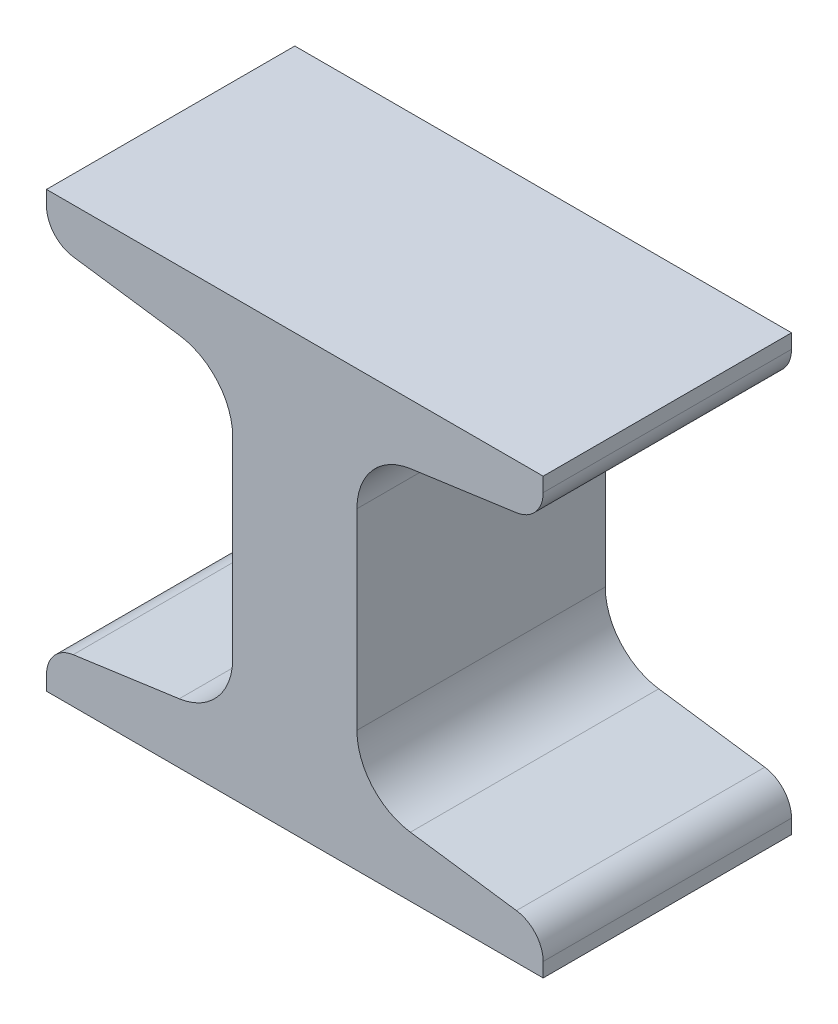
ISO-10303-21;
HEADER;
FILE_DESCRIPTION(('STEP AP214'),'2;1');
FILE_NAME('part.step','',(''),(''),'','','');
FILE_SCHEMA(('AUTOMOTIVE_DESIGN { 1 0 10303 214 1 1 1 1 }'));
ENDSEC;
DATA;
#1=APPLICATION_CONTEXT('core data for automotive mechanical design processes');
#2=APPLICATION_PROTOCOL_DEFINITION('international standard','automotive_design',2000,#1);
#3=PRODUCT_CONTEXT('',#1,'mechanical');
#4=PRODUCT('Part','Part','',(#3));
#5=PRODUCT_RELATED_PRODUCT_CATEGORY('part','',(#4));
#6=PRODUCT_DEFINITION_FORMATION('','',#4);
#7=PRODUCT_DEFINITION_CONTEXT('part definition',#1,'design');
#8=PRODUCT_DEFINITION('design','',#6,#7);
#9=PRODUCT_DEFINITION_SHAPE('','',#8);
#10=(LENGTH_UNIT() NAMED_UNIT(*) SI_UNIT(.MILLI.,.METRE.));
#11=(NAMED_UNIT(*) PLANE_ANGLE_UNIT() SI_UNIT($,.RADIAN.));
#12=(NAMED_UNIT(*) SI_UNIT($,.STERADIAN.) SOLID_ANGLE_UNIT());
#13=UNCERTAINTY_MEASURE_WITH_UNIT(LENGTH_MEASURE(1.E-05),#10,'distance_accuracy_value','');
#14=(GEOMETRIC_REPRESENTATION_CONTEXT(3) GLOBAL_UNCERTAINTY_ASSIGNED_CONTEXT((#13)) GLOBAL_UNIT_ASSIGNED_CONTEXT((#10,
#11,#12)) REPRESENTATION_CONTEXT('',''));
#15=CARTESIAN_POINT('',(0.,0.,0.));
#16=DIRECTION('',(0.,0.,1.));
#17=DIRECTION('',(1.,0.,0.));
#18=AXIS2_PLACEMENT_3D('',#15,#16,#17);
#19=CARTESIAN_POINT('',(50.8,-4.57140674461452E-13,12.7));
#20=DIRECTION('',(0.,-1.,0.));
#21=DIRECTION('',(1.,0.,0.));
#22=AXIS2_PLACEMENT_3D('',#19,#20,#21);
#23=PLANE('',#22);
#24=DIRECTION('',(-1.,0.,0.));
#25=VECTOR('',#24,1.);
#26=CARTESIAN_POINT('',(50.8,-4.57140674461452E-13,-12.7));
#27=LINE('',#26,#25);
#28=CARTESIAN_POINT('',(50.8,-4.57140674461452E-13,-12.7));
#29=VERTEX_POINT('',#28);
#30=CARTESIAN_POINT('',(0.,0.,-12.7));
#31=VERTEX_POINT('',#30);
#32=EDGE_CURVE('E234',#29,#31,#27,.T.);
#33=ORIENTED_EDGE('',*,*,#32,.F.);
#34=DIRECTION('',(0.,0.,-1.));
#35=VECTOR('',#34,1.);
#36=CARTESIAN_POINT('',(50.8,-4.57140674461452E-13,12.7));
#37=LINE('',#36,#35);
#38=CARTESIAN_POINT('',(50.8,-4.57140674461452E-13,12.7));
#39=VERTEX_POINT('',#38);
#40=EDGE_CURVE('E192',#39,#29,#37,.T.);
#41=ORIENTED_EDGE('',*,*,#40,.F.);
#42=DIRECTION('',(-1.,0.,0.));
#43=VECTOR('',#42,1.);
#44=CARTESIAN_POINT('',(50.8,-4.57140674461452E-13,12.7));
#45=LINE('',#44,#43);
#46=CARTESIAN_POINT('',(0.,0.,12.7));
#47=VERTEX_POINT('',#46);
#48=EDGE_CURVE('E187',#39,#47,#45,.T.);
#49=ORIENTED_EDGE('',*,*,#48,.T.);
#50=DIRECTION('',(0.,0.,-1.));
#51=VECTOR('',#50,1.);
#52=CARTESIAN_POINT('',(0.,0.,12.7));
#53=LINE('',#52,#51);
#54=EDGE_CURVE('E170',#47,#31,#53,.T.);
#55=ORIENTED_EDGE('',*,*,#54,.T.);
#56=EDGE_LOOP('',(#33,#41,#49,#55));
#57=FACE_BOUND('',#56,.T.);
#58=ADVANCED_FACE('F33',(#57),#23,.T.);
#59=CARTESIAN_POINT('',(50.8,4.22213794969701,12.7));
#60=DIRECTION('',(1.,0.,0.));
#61=DIRECTION('',(0.,1.,0.));
#62=AXIS2_PLACEMENT_3D('',#59,#60,#61);
#63=PLANE('',#62);
#64=DIRECTION('',(0.,-1.,0.));
#65=VECTOR('',#64,1.);
#66=CARTESIAN_POINT('',(50.8,4.22213794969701,-12.7));
#67=LINE('',#66,#65);
#68=CARTESIAN_POINT('',(50.8,1.46064423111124,-12.7));
#69=VERTEX_POINT('',#68);
#70=EDGE_CURVE('E193',#69,#29,#67,.T.);
#71=ORIENTED_EDGE('',*,*,#70,.F.);
#72=DIRECTION('',(0.,0.,-1.));
#73=VECTOR('',#72,1.);
#74=CARTESIAN_POINT('',(50.8,1.46064423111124,12.7));
#75=LINE('',#74,#73);
#76=CARTESIAN_POINT('',(50.8,1.46064423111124,12.7));
#77=VERTEX_POINT('',#76);
#78=EDGE_CURVE('E306',#69,#77,#75,.F.);
#79=ORIENTED_EDGE('',*,*,#78,.T.);
#80=DIRECTION('',(0.,-1.,0.));
#81=VECTOR('',#80,1.);
#82=CARTESIAN_POINT('',(50.8,4.22213794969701,12.7));
#83=LINE('',#82,#81);
#84=EDGE_CURVE('E182',#77,#39,#83,.T.);
#85=ORIENTED_EDGE('',*,*,#84,.T.);
#86=ORIENTED_EDGE('',*,*,#40,.T.);
#87=EDGE_LOOP('',(#71,#79,#85,#86));
#88=FACE_BOUND('',#87,.T.);
#89=ADVANCED_FACE('F383',(#88),#63,.T.);
#90=CARTESIAN_POINT('',(37.2196531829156,6.12323899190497,12.7));
#91=DIRECTION('',(0.138637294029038,0.990343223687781,0.));
#92=DIRECTION('',(-0.990343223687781,0.138637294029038,0.));
#93=AXIS2_PLACEMENT_3D('',#90,#91,#92);
#94=PLANE('',#93);
#95=DIRECTION('',(0.990343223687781,-0.138637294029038,0.));
#96=VECTOR('',#95,1.);
#97=CARTESIAN_POINT('',(37.2196531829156,6.12323899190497,12.7));
#98=LINE('',#97,#96);
#99=CARTESIAN_POINT('',(37.2196531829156,6.12323899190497,12.7));
#100=VERTEX_POINT('',#99);
#101=CARTESIAN_POINT('',(48.0651734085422,4.60498396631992,12.7));
#102=VERTEX_POINT('',#101);
#103=EDGE_CURVE('E230',#100,#102,#98,.T.);
#104=ORIENTED_EDGE('',*,*,#103,.T.);
#105=DIRECTION('',(0.,0.,-1.));
#106=VECTOR('',#105,1.);
#107=CARTESIAN_POINT('',(48.0651734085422,4.60498396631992,12.7));
#108=LINE('',#107,#106);
#109=CARTESIAN_POINT('',(48.0651734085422,4.60498396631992,-12.7));
#110=VERTEX_POINT('',#109);
#111=EDGE_CURVE('E273',#102,#110,#108,.T.);
#112=ORIENTED_EDGE('',*,*,#111,.T.);
#113=DIRECTION('',(0.990343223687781,-0.138637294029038,0.));
#114=VECTOR('',#113,1.);
#115=CARTESIAN_POINT('',(37.2196531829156,6.12323899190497,-12.7));
#116=LINE('',#115,#114);
#117=CARTESIAN_POINT('',(37.2196531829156,6.12323899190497,-12.7));
#118=VERTEX_POINT('',#117);
#119=EDGE_CURVE('E195',#118,#110,#116,.T.);
#120=ORIENTED_EDGE('',*,*,#119,.F.);
#121=DIRECTION('',(0.,0.,-1.));
#122=VECTOR('',#121,1.);
#123=CARTESIAN_POINT('',(37.2196531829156,6.12323899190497,12.7));
#124=LINE('',#123,#122);
#125=EDGE_CURVE('E274',#100,#118,#124,.T.);
#126=ORIENTED_EDGE('',*,*,#125,.F.);
#127=EDGE_LOOP('',(#104,#112,#120,#126));
#128=FACE_BOUND('',#127,.T.);
#129=ADVANCED_FACE('F377',(#128),#94,.T.);
#130=CARTESIAN_POINT('',(38.1,12.4119184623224,12.7));
#131=DIRECTION('',(0.,0.,-1.));
#132=DIRECTION('',(-1.,0.,0.));
#133=AXIS2_PLACEMENT_3D('',#130,#131,#132);
#134=CYLINDRICAL_SURFACE('',#133,6.35);
#135=CARTESIAN_POINT('',(38.1,12.4119184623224,-12.7));
#136=DIRECTION('',(0.,0.,1.));
#137=DIRECTION('',(1.,0.,0.));
#138=AXIS2_PLACEMENT_3D('',#135,#136,#137);
#139=CIRCLE('',#138,6.35);
#140=CARTESIAN_POINT('',(31.75,12.4119184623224,-12.7));
#141=VERTEX_POINT('',#140);
#142=EDGE_CURVE('E267',#141,#118,#139,.T.);
#143=ORIENTED_EDGE('',*,*,#142,.F.);
#144=DIRECTION('',(0.,0.,-1.));
#145=VECTOR('',#144,1.);
#146=CARTESIAN_POINT('',(31.75,12.4119184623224,12.7));
#147=LINE('',#146,#145);
#148=CARTESIAN_POINT('',(31.75,12.4119184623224,12.7));
#149=VERTEX_POINT('',#148);
#150=EDGE_CURVE('E276',#149,#141,#147,.T.);
#151=ORIENTED_EDGE('',*,*,#150,.F.);
#152=CARTESIAN_POINT('',(38.1,12.4119184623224,12.7));
#153=DIRECTION('',(0.,0.,1.));
#154=DIRECTION('',(1.,0.,0.));
#155=AXIS2_PLACEMENT_3D('',#152,#153,#154);
#156=CIRCLE('',#155,6.35);
#157=EDGE_CURVE('E227',#149,#100,#156,.T.);
#158=ORIENTED_EDGE('',*,*,#157,.T.);
#159=ORIENTED_EDGE('',*,*,#125,.T.);
#160=EDGE_LOOP('',(#143,#151,#158,#159));
#161=FACE_BOUND('',#160,.T.);
#162=ADVANCED_FACE('F373',(#161),#134,.F.);
#163=CARTESIAN_POINT('',(31.75,32.0380815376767,12.7));
#164=DIRECTION('',(1.,0.,0.));
#165=DIRECTION('',(0.,1.,0.));
#166=AXIS2_PLACEMENT_3D('',#163,#164,#165);
#167=PLANE('',#166);
#168=DIRECTION('',(0.,-1.,0.));
#169=VECTOR('',#168,1.);
#170=CARTESIAN_POINT('',(31.75,32.0380815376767,-12.7));
#171=LINE('',#170,#169);
#172=CARTESIAN_POINT('',(31.75,32.0380815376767,-12.7));
#173=VERTEX_POINT('',#172);
#174=EDGE_CURVE('E264',#173,#141,#171,.T.);
#175=ORIENTED_EDGE('',*,*,#174,.F.);
#176=DIRECTION('',(0.,0.,-1.));
#177=VECTOR('',#176,1.);
#178=CARTESIAN_POINT('',(31.75,32.0380815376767,12.7));
#179=LINE('',#178,#177);
#180=CARTESIAN_POINT('',(31.75,32.0380815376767,12.7));
#181=VERTEX_POINT('',#180);
#182=EDGE_CURVE('E278',#181,#173,#179,.T.);
#183=ORIENTED_EDGE('',*,*,#182,.F.);
#184=DIRECTION('',(0.,-1.,0.));
#185=VECTOR('',#184,1.);
#186=CARTESIAN_POINT('',(31.75,32.0380815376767,12.7));
#187=LINE('',#186,#185);
#188=EDGE_CURVE('E224',#181,#149,#187,.T.);
#189=ORIENTED_EDGE('',*,*,#188,.T.);
#190=ORIENTED_EDGE('',*,*,#150,.T.);
#191=EDGE_LOOP('',(#175,#183,#189,#190));
#192=FACE_BOUND('',#191,.T.);
#193=ADVANCED_FACE('F369',(#192),#167,.T.);
#194=CARTESIAN_POINT('',(38.1,32.0380815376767,12.7));
#195=DIRECTION('',(0.,0.,-1.));
#196=DIRECTION('',(-1.,0.,0.));
#197=AXIS2_PLACEMENT_3D('',#194,#195,#196);
#198=CYLINDRICAL_SURFACE('',#197,6.34999999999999);
#199=CARTESIAN_POINT('',(38.1,32.0380815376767,-12.7));
#200=DIRECTION('',(0.,0.,1.));
#201=DIRECTION('',(1.,0.,0.));
#202=AXIS2_PLACEMENT_3D('',#199,#200,#201);
#203=CIRCLE('',#202,6.34999999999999);
#204=CARTESIAN_POINT('',(37.2196531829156,38.3267610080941,-12.7));
#205=VERTEX_POINT('',#204);
#206=EDGE_CURVE('E261',#205,#173,#203,.T.);
#207=ORIENTED_EDGE('',*,*,#206,.F.);
#208=DIRECTION('',(0.,0.,-1.));
#209=VECTOR('',#208,1.);
#210=CARTESIAN_POINT('',(37.2196531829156,38.3267610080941,12.7));
#211=LINE('',#210,#209);
#212=CARTESIAN_POINT('',(37.2196531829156,38.3267610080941,12.7));
#213=VERTEX_POINT('',#212);
#214=EDGE_CURVE('E280',#213,#205,#211,.T.);
#215=ORIENTED_EDGE('',*,*,#214,.F.);
#216=CARTESIAN_POINT('',(38.1,32.0380815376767,12.7));
#217=DIRECTION('',(0.,0.,1.));
#218=DIRECTION('',(1.,0.,0.));
#219=AXIS2_PLACEMENT_3D('',#216,#217,#218);
#220=CIRCLE('',#219,6.34999999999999);
#221=EDGE_CURVE('E221',#213,#181,#220,.T.);
#222=ORIENTED_EDGE('',*,*,#221,.T.);
#223=ORIENTED_EDGE('',*,*,#182,.T.);
#224=EDGE_LOOP('',(#207,#215,#222,#223));
#225=FACE_BOUND('',#224,.T.);
#226=ADVANCED_FACE('F365',(#225),#198,.F.);
#227=CARTESIAN_POINT('',(50.8,40.2278620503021,12.7));
#228=DIRECTION('',(0.138637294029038,-0.990343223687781,0.));
#229=DIRECTION('',(0.990343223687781,0.138637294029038,0.));
#230=AXIS2_PLACEMENT_3D('',#227,#228,#229);
#231=PLANE('',#230);
#232=DIRECTION('',(-0.990343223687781,-0.138637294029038,0.));
#233=VECTOR('',#232,1.);
#234=CARTESIAN_POINT('',(50.8,40.2278620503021,-12.7));
#235=LINE('',#234,#233);
#236=CARTESIAN_POINT('',(48.0651734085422,39.8450160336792,-12.7));
#237=VERTEX_POINT('',#236);
#238=EDGE_CURVE('E259',#237,#205,#235,.T.);
#239=ORIENTED_EDGE('',*,*,#238,.F.);
#240=DIRECTION('',(0.,0.,-1.));
#241=VECTOR('',#240,1.);
#242=CARTESIAN_POINT('',(48.0651734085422,39.8450160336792,12.7));
#243=LINE('',#242,#241);
#244=CARTESIAN_POINT('',(48.0651734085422,39.8450160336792,12.7));
#245=VERTEX_POINT('',#244);
#246=EDGE_CURVE('E321',#237,#245,#243,.F.);
#247=ORIENTED_EDGE('',*,*,#246,.T.);
#248=DIRECTION('',(-0.990343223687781,-0.138637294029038,0.));
#249=VECTOR('',#248,1.);
#250=CARTESIAN_POINT('',(50.8,40.2278620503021,12.7));
#251=LINE('',#250,#249);
#252=EDGE_CURVE('E219',#245,#213,#251,.T.);
#253=ORIENTED_EDGE('',*,*,#252,.T.);
#254=ORIENTED_EDGE('',*,*,#214,.T.);
#255=EDGE_LOOP('',(#239,#247,#253,#254));
#256=FACE_BOUND('',#255,.T.);
#257=ADVANCED_FACE('F359',(#256),#231,.T.);
#258=CARTESIAN_POINT('',(50.8,44.4499999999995,12.7));
#259=DIRECTION('',(1.,0.,0.));
#260=DIRECTION('',(0.,1.,0.));
#261=AXIS2_PLACEMENT_3D('',#258,#259,#260);
#262=PLANE('',#261);
#263=DIRECTION('',(0.,-1.,0.));
#264=VECTOR('',#263,1.);
#265=CARTESIAN_POINT('',(50.8,44.4499999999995,12.7));
#266=LINE('',#265,#264);
#267=CARTESIAN_POINT('',(50.8,44.4499999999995,12.7));
#268=VERTEX_POINT('',#267);
#269=CARTESIAN_POINT('',(50.8,42.9893557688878,12.7));
#270=VERTEX_POINT('',#269);
#271=EDGE_CURVE('E216',#268,#270,#266,.T.);
#272=ORIENTED_EDGE('',*,*,#271,.T.);
#273=DIRECTION('',(0.,0.,-1.));
#274=VECTOR('',#273,1.);
#275=CARTESIAN_POINT('',(50.8,42.9893557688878,12.7));
#276=LINE('',#275,#274);
#277=CARTESIAN_POINT('',(50.8,42.9893557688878,-12.7));
#278=VERTEX_POINT('',#277);
#279=EDGE_CURVE('E318',#270,#278,#276,.T.);
#280=ORIENTED_EDGE('',*,*,#279,.T.);
#281=DIRECTION('',(0.,-1.,0.));
#282=VECTOR('',#281,1.);
#283=CARTESIAN_POINT('',(50.8,44.4499999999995,-12.7));
#284=LINE('',#283,#282);
#285=CARTESIAN_POINT('',(50.8,44.4499999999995,-12.7));
#286=VERTEX_POINT('',#285);
#287=EDGE_CURVE('E256',#286,#278,#284,.T.);
#288=ORIENTED_EDGE('',*,*,#287,.F.);
#289=DIRECTION('',(0.,0.,-1.));
#290=VECTOR('',#289,1.);
#291=CARTESIAN_POINT('',(50.8,44.4499999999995,12.7));
#292=LINE('',#291,#290);
#293=EDGE_CURVE('E283',#268,#286,#292,.T.);
#294=ORIENTED_EDGE('',*,*,#293,.F.);
#295=EDGE_LOOP('',(#272,#280,#288,#294));
#296=FACE_BOUND('',#295,.T.);
#297=ADVANCED_FACE('F351',(#296),#262,.T.);
#298=CARTESIAN_POINT('',(0.,44.4499999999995,12.7));
#299=DIRECTION('',(0.,1.,0.));
#300=DIRECTION('',(0.,0.,1.));
#301=AXIS2_PLACEMENT_3D('',#298,#299,#300);
#302=PLANE('',#301);
#303=DIRECTION('',(1.,0.,0.));
#304=VECTOR('',#303,1.);
#305=CARTESIAN_POINT('',(0.,44.4499999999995,-12.7));
#306=LINE('',#305,#304);
#307=CARTESIAN_POINT('',(0.,44.4499999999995,-12.7));
#308=VERTEX_POINT('',#307);
#309=EDGE_CURVE('E253',#308,#286,#306,.T.);
#310=ORIENTED_EDGE('',*,*,#309,.F.);
#311=DIRECTION('',(0.,0.,-1.));
#312=VECTOR('',#311,1.);
#313=CARTESIAN_POINT('',(0.,44.4499999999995,12.7));
#314=LINE('',#313,#312);
#315=CARTESIAN_POINT('',(0.,44.4499999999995,12.7));
#316=VERTEX_POINT('',#315);
#317=EDGE_CURVE('E285',#316,#308,#314,.T.);
#318=ORIENTED_EDGE('',*,*,#317,.F.);
#319=DIRECTION('',(1.,0.,0.));
#320=VECTOR('',#319,1.);
#321=CARTESIAN_POINT('',(0.,44.4499999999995,12.7));
#322=LINE('',#321,#320);
#323=EDGE_CURVE('E213',#316,#268,#322,.T.);
#324=ORIENTED_EDGE('',*,*,#323,.T.);
#325=ORIENTED_EDGE('',*,*,#293,.T.);
#326=EDGE_LOOP('',(#310,#318,#324,#325));
#327=FACE_BOUND('',#326,.T.);
#328=ADVANCED_FACE('F348',(#327),#302,.T.);
#329=CARTESIAN_POINT('',(0.,40.2278620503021,12.7));
#330=DIRECTION('',(-1.,0.,0.));
#331=DIRECTION('',(0.,-1.,0.));
#332=AXIS2_PLACEMENT_3D('',#329,#330,#331);
#333=PLANE('',#332);
#334=DIRECTION('',(0.,1.,0.));
#335=VECTOR('',#334,1.);
#336=CARTESIAN_POINT('',(0.,40.2278620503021,-12.7));
#337=LINE('',#336,#335);
#338=CARTESIAN_POINT('',(0.,42.9893557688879,-12.7));
#339=VERTEX_POINT('',#338);
#340=EDGE_CURVE('E251',#339,#308,#337,.T.);
#341=ORIENTED_EDGE('',*,*,#340,.F.);
#342=DIRECTION('',(0.,0.,-1.));
#343=VECTOR('',#342,1.);
#344=CARTESIAN_POINT('',(0.,42.9893557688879,12.7));
#345=LINE('',#344,#343);
#346=CARTESIAN_POINT('',(0.,42.9893557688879,12.7));
#347=VERTEX_POINT('',#346);
#348=EDGE_CURVE('E11',#339,#347,#345,.F.);
#349=ORIENTED_EDGE('',*,*,#348,.T.);
#350=DIRECTION('',(0.,1.,0.));
#351=VECTOR('',#350,1.);
#352=CARTESIAN_POINT('',(0.,40.2278620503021,12.7));
#353=LINE('',#352,#351);
#354=EDGE_CURVE('E211',#347,#316,#353,.T.);
#355=ORIENTED_EDGE('',*,*,#354,.T.);
#356=ORIENTED_EDGE('',*,*,#317,.T.);
#357=EDGE_LOOP('',(#341,#349,#355,#356));
#358=FACE_BOUND('',#357,.T.);
#359=ADVANCED_FACE('F343',(#358),#333,.T.);
#360=CARTESIAN_POINT('',(13.5803468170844,38.3267610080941,12.7));
#361=DIRECTION('',(-0.138637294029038,-0.990343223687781,0.));
#362=DIRECTION('',(0.990343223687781,-0.138637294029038,0.));
#363=AXIS2_PLACEMENT_3D('',#360,#361,#362);
#364=PLANE('',#363);
#365=DIRECTION('',(-0.990343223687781,0.138637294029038,0.));
#366=VECTOR('',#365,1.);
#367=CARTESIAN_POINT('',(13.5803468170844,38.3267610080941,12.7));
#368=LINE('',#367,#366);
#369=CARTESIAN_POINT('',(13.5803468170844,38.3267610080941,12.7));
#370=VERTEX_POINT('',#369);
#371=CARTESIAN_POINT('',(2.73482659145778,39.8450160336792,12.7));
#372=VERTEX_POINT('',#371);
#373=EDGE_CURVE('E208',#370,#372,#368,.T.);
#374=ORIENTED_EDGE('',*,*,#373,.T.);
#375=DIRECTION('',(0.,0.,-1.));
#376=VECTOR('',#375,1.);
#377=CARTESIAN_POINT('',(2.73482659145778,39.8450160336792,12.7));
#378=LINE('',#377,#376);
#379=CARTESIAN_POINT('',(2.73482659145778,39.8450160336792,-12.7));
#380=VERTEX_POINT('',#379);
#381=EDGE_CURVE('E41',#372,#380,#378,.T.);
#382=ORIENTED_EDGE('',*,*,#381,.T.);
#383=DIRECTION('',(-0.990343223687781,0.138637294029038,0.));
#384=VECTOR('',#383,1.);
#385=CARTESIAN_POINT('',(13.5803468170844,38.3267610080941,-12.7));
#386=LINE('',#385,#384);
#387=CARTESIAN_POINT('',(13.5803468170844,38.3267610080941,-12.7));
#388=VERTEX_POINT('',#387);
#389=EDGE_CURVE('E248',#388,#380,#386,.T.);
#390=ORIENTED_EDGE('',*,*,#389,.F.);
#391=DIRECTION('',(0.,0.,-1.));
#392=VECTOR('',#391,1.);
#393=CARTESIAN_POINT('',(13.5803468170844,38.3267610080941,12.7));
#394=LINE('',#393,#392);
#395=EDGE_CURVE('E288',#370,#388,#394,.T.);
#396=ORIENTED_EDGE('',*,*,#395,.F.);
#397=EDGE_LOOP('',(#374,#382,#390,#396));
#398=FACE_BOUND('',#397,.T.);
#399=ADVANCED_FACE('F326',(#398),#364,.T.);
#400=CARTESIAN_POINT('',(12.7,32.0380815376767,12.7));
#401=DIRECTION('',(0.,0.,-1.));
#402=DIRECTION('',(-1.,0.,0.));
#403=AXIS2_PLACEMENT_3D('',#400,#401,#402);
#404=CYLINDRICAL_SURFACE('',#403,6.35);
#405=CARTESIAN_POINT('',(12.7,32.0380815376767,-12.7));
#406=DIRECTION('',(0.,0.,1.));
#407=DIRECTION('',(1.,0.,0.));
#408=AXIS2_PLACEMENT_3D('',#405,#406,#407);
#409=CIRCLE('',#408,6.35);
#410=CARTESIAN_POINT('',(19.05,32.0380815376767,-12.7));
#411=VERTEX_POINT('',#410);
#412=EDGE_CURVE('E245',#411,#388,#409,.T.);
#413=ORIENTED_EDGE('',*,*,#412,.F.);
#414=DIRECTION('',(0.,0.,-1.));
#415=VECTOR('',#414,1.);
#416=CARTESIAN_POINT('',(19.05,32.0380815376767,12.7));
#417=LINE('',#416,#415);
#418=CARTESIAN_POINT('',(19.05,32.0380815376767,12.7));
#419=VERTEX_POINT('',#418);
#420=EDGE_CURVE('E290',#419,#411,#417,.T.);
#421=ORIENTED_EDGE('',*,*,#420,.F.);
#422=CARTESIAN_POINT('',(12.7,32.0380815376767,12.7));
#423=DIRECTION('',(0.,0.,1.));
#424=DIRECTION('',(1.,0.,0.));
#425=AXIS2_PLACEMENT_3D('',#422,#423,#424);
#426=CIRCLE('',#425,6.35);
#427=EDGE_CURVE('E205',#419,#370,#426,.T.);
#428=ORIENTED_EDGE('',*,*,#427,.T.);
#429=ORIENTED_EDGE('',*,*,#395,.T.);
#430=EDGE_LOOP('',(#413,#421,#428,#429));
#431=FACE_BOUND('',#430,.T.);
#432=ADVANCED_FACE('F336',(#431),#404,.F.);
#433=CARTESIAN_POINT('',(19.05,12.4119184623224,12.7));
#434=DIRECTION('',(-1.,0.,0.));
#435=DIRECTION('',(0.,0.,1.));
#436=AXIS2_PLACEMENT_3D('',#433,#434,#435);
#437=PLANE('',#436);
#438=DIRECTION('',(0.,1.,0.));
#439=VECTOR('',#438,1.);
#440=CARTESIAN_POINT('',(19.05,12.4119184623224,-12.7));
#441=LINE('',#440,#439);
#442=CARTESIAN_POINT('',(19.05,12.4119184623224,-12.7));
#443=VERTEX_POINT('',#442);
#444=EDGE_CURVE('E242',#443,#411,#441,.T.);
#445=ORIENTED_EDGE('',*,*,#444,.F.);
#446=DIRECTION('',(0.,0.,-1.));
#447=VECTOR('',#446,1.);
#448=CARTESIAN_POINT('',(19.05,12.4119184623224,12.7));
#449=LINE('',#448,#447);
#450=CARTESIAN_POINT('',(19.05,12.4119184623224,12.7));
#451=VERTEX_POINT('',#450);
#452=EDGE_CURVE('E292',#451,#443,#449,.T.);
#453=ORIENTED_EDGE('',*,*,#452,.F.);
#454=DIRECTION('',(0.,1.,0.));
#455=VECTOR('',#454,1.);
#456=CARTESIAN_POINT('',(19.05,12.4119184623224,12.7));
#457=LINE('',#456,#455);
#458=EDGE_CURVE('E202',#451,#419,#457,.T.);
#459=ORIENTED_EDGE('',*,*,#458,.T.);
#460=ORIENTED_EDGE('',*,*,#420,.T.);
#461=EDGE_LOOP('',(#445,#453,#459,#460));
#462=FACE_BOUND('',#461,.T.);
#463=ADVANCED_FACE('F411',(#462),#437,.T.);
#464=CARTESIAN_POINT('',(12.7,12.4119184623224,12.7));
#465=DIRECTION('',(0.,0.,-1.));
#466=DIRECTION('',(-1.,0.,0.));
#467=AXIS2_PLACEMENT_3D('',#464,#465,#466);
#468=CYLINDRICAL_SURFACE('',#467,6.35);
#469=CARTESIAN_POINT('',(12.7,12.4119184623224,-12.7));
#470=DIRECTION('',(0.,0.,1.));
#471=DIRECTION('',(1.,0.,0.));
#472=AXIS2_PLACEMENT_3D('',#469,#470,#471);
#473=CIRCLE('',#472,6.35);
#474=CARTESIAN_POINT('',(13.5803468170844,6.12323899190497,-12.7));
#475=VERTEX_POINT('',#474);
#476=EDGE_CURVE('E239',#475,#443,#473,.T.);
#477=ORIENTED_EDGE('',*,*,#476,.F.);
#478=DIRECTION('',(0.,0.,-1.));
#479=VECTOR('',#478,1.);
#480=CARTESIAN_POINT('',(13.5803468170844,6.12323899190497,12.7));
#481=LINE('',#480,#479);
#482=CARTESIAN_POINT('',(13.5803468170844,6.12323899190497,12.7));
#483=VERTEX_POINT('',#482);
#484=EDGE_CURVE('E181',#483,#475,#481,.T.);
#485=ORIENTED_EDGE('',*,*,#484,.F.);
#486=CARTESIAN_POINT('',(12.7,12.4119184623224,12.7));
#487=DIRECTION('',(0.,0.,1.));
#488=DIRECTION('',(1.,0.,0.));
#489=AXIS2_PLACEMENT_3D('',#486,#487,#488);
#490=CIRCLE('',#489,6.35);
#491=EDGE_CURVE('E199',#483,#451,#490,.T.);
#492=ORIENTED_EDGE('',*,*,#491,.T.);
#493=ORIENTED_EDGE('',*,*,#452,.T.);
#494=EDGE_LOOP('',(#477,#485,#492,#493));
#495=FACE_BOUND('',#494,.T.);
#496=ADVANCED_FACE('F408',(#495),#468,.F.);
#497=CARTESIAN_POINT('',(0.,4.222137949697,12.7));
#498=DIRECTION('',(-0.138637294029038,0.990343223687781,0.));
#499=DIRECTION('',(-0.990343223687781,-0.138637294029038,0.));
#500=AXIS2_PLACEMENT_3D('',#497,#498,#499);
#501=PLANE('',#500);
#502=DIRECTION('',(0.990343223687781,0.138637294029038,0.));
#503=VECTOR('',#502,1.);
#504=CARTESIAN_POINT('',(0.,4.222137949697,-12.7));
#505=LINE('',#504,#503);
#506=CARTESIAN_POINT('',(2.73482659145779,4.60498396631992,-12.7));
#507=VERTEX_POINT('',#506);
#508=EDGE_CURVE('E237',#507,#475,#505,.T.);
#509=ORIENTED_EDGE('',*,*,#508,.F.);
#510=DIRECTION('',(0.,0.,-1.));
#511=VECTOR('',#510,1.);
#512=CARTESIAN_POINT('',(2.73482659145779,4.60498396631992,12.7));
#513=LINE('',#512,#511);
#514=CARTESIAN_POINT('',(2.73482659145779,4.60498396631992,12.7));
#515=VERTEX_POINT('',#514);
#516=EDGE_CURVE('E56',#507,#515,#513,.F.);
#517=ORIENTED_EDGE('',*,*,#516,.T.);
#518=DIRECTION('',(0.990343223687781,0.138637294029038,0.));
#519=VECTOR('',#518,1.);
#520=CARTESIAN_POINT('',(0.,4.222137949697,12.7));
#521=LINE('',#520,#519);
#522=EDGE_CURVE('E188',#515,#483,#521,.T.);
#523=ORIENTED_EDGE('',*,*,#522,.T.);
#524=ORIENTED_EDGE('',*,*,#484,.T.);
#525=EDGE_LOOP('',(#509,#517,#523,#524));
#526=FACE_BOUND('',#525,.T.);
#527=ADVANCED_FACE('F405',(#526),#501,.T.);
#528=CARTESIAN_POINT('',(0.,0.,12.7));
#529=DIRECTION('',(-1.,0.,0.));
#530=DIRECTION('',(0.,-1.,0.));
#531=AXIS2_PLACEMENT_3D('',#528,#529,#530);
#532=PLANE('',#531);
#533=DIRECTION('',(0.,1.,0.));
#534=VECTOR('',#533,1.);
#535=CARTESIAN_POINT('',(0.,0.,12.7));
#536=LINE('',#535,#534);
#537=CARTESIAN_POINT('',(0.,1.46064423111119,12.7));
#538=VERTEX_POINT('',#537);
#539=EDGE_CURVE('E173',#47,#538,#536,.T.);
#540=ORIENTED_EDGE('',*,*,#539,.T.);
#541=DIRECTION('',(0.,0.,-1.));
#542=VECTOR('',#541,1.);
#543=CARTESIAN_POINT('',(0.,1.46064423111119,12.7));
#544=LINE('',#543,#542);
#545=CARTESIAN_POINT('',(0.,1.46064423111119,-12.7));
#546=VERTEX_POINT('',#545);
#547=EDGE_CURVE('E315',#538,#546,#544,.T.);
#548=ORIENTED_EDGE('',*,*,#547,.T.);
#549=DIRECTION('',(0.,1.,0.));
#550=VECTOR('',#549,1.);
#551=CARTESIAN_POINT('',(0.,0.,-12.7));
#552=LINE('',#551,#550);
#553=EDGE_CURVE('E176',#31,#546,#552,.T.);
#554=ORIENTED_EDGE('',*,*,#553,.F.);
#555=ORIENTED_EDGE('',*,*,#54,.F.);
#556=EDGE_LOOP('',(#540,#548,#554,#555));
#557=FACE_BOUND('',#556,.T.);
#558=ADVANCED_FACE('F171',(#557),#532,.T.);
#559=CARTESIAN_POINT('',(12.7,12.4119184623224,12.7));
#560=DIRECTION('',(0.,0.,1.));
#561=DIRECTION('',(1.,0.,0.));
#562=AXIS2_PLACEMENT_3D('',#559,#560,#561);
#563=PLANE('',#562);
#564=ORIENTED_EDGE('',*,*,#84,.F.);
#565=CARTESIAN_POINT('',(47.625,1.46064423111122,12.7));
#566=DIRECTION('',(0.,0.,1.));
#567=DIRECTION('',(1.,0.,0.));
#568=AXIS2_PLACEMENT_3D('',#565,#566,#567);
#569=CIRCLE('',#568,3.175);
#570=EDGE_CURVE('E313',#77,#102,#569,.T.);
#571=ORIENTED_EDGE('',*,*,#570,.T.);
#572=ORIENTED_EDGE('',*,*,#103,.F.);
#573=ORIENTED_EDGE('',*,*,#157,.F.);
#574=ORIENTED_EDGE('',*,*,#188,.F.);
#575=ORIENTED_EDGE('',*,*,#221,.F.);
#576=ORIENTED_EDGE('',*,*,#252,.F.);
#577=CARTESIAN_POINT('',(47.625,42.9893557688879,12.7));
#578=DIRECTION('',(0.,0.,1.));
#579=DIRECTION('',(1.,0.,0.));
#580=AXIS2_PLACEMENT_3D('',#577,#578,#579);
#581=CIRCLE('',#580,3.175);
#582=EDGE_CURVE('E310',#245,#270,#581,.T.);
#583=ORIENTED_EDGE('',*,*,#582,.T.);
#584=ORIENTED_EDGE('',*,*,#271,.F.);
#585=ORIENTED_EDGE('',*,*,#323,.F.);
#586=ORIENTED_EDGE('',*,*,#354,.F.);
#587=CARTESIAN_POINT('',(3.17499999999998,42.9893557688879,12.7));
#588=DIRECTION('',(0.,0.,1.));
#589=DIRECTION('',(1.,0.,0.));
#590=AXIS2_PLACEMENT_3D('',#587,#588,#589);
#591=CIRCLE('',#590,3.175);
#592=EDGE_CURVE('E308',#347,#372,#591,.T.);
#593=ORIENTED_EDGE('',*,*,#592,.T.);
#594=ORIENTED_EDGE('',*,*,#373,.F.);
#595=ORIENTED_EDGE('',*,*,#427,.F.);
#596=ORIENTED_EDGE('',*,*,#458,.F.);
#597=ORIENTED_EDGE('',*,*,#491,.F.);
#598=ORIENTED_EDGE('',*,*,#522,.F.);
#599=CARTESIAN_POINT('',(3.17499999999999,1.46064423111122,12.7));
#600=DIRECTION('',(0.,0.,1.));
#601=DIRECTION('',(1.,0.,0.));
#602=AXIS2_PLACEMENT_3D('',#599,#600,#601);
#603=CIRCLE('',#602,3.175);
#604=EDGE_CURVE('E48',#515,#538,#603,.T.);
#605=ORIENTED_EDGE('',*,*,#604,.T.);
#606=ORIENTED_EDGE('',*,*,#539,.F.);
#607=ORIENTED_EDGE('',*,*,#48,.F.);
#608=EDGE_LOOP('',(#564,#571,#572,#573,#574,#575,#576,#583,#584,#585,#586,#593,#594,#595,#596,
#597,#598,#605,#606,#607));
#609=FACE_BOUND('',#608,.T.);
#610=ADVANCED_FACE('F186',(#609),#563,.T.);
#611=CARTESIAN_POINT('',(12.7,12.4119184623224,-12.7));
#612=DIRECTION('',(0.,0.,1.));
#613=DIRECTION('',(1.,0.,0.));
#614=AXIS2_PLACEMENT_3D('',#611,#612,#613);
#615=PLANE('',#614);
#616=ORIENTED_EDGE('',*,*,#119,.T.);
#617=CARTESIAN_POINT('',(47.625,1.46064423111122,-12.7));
#618=DIRECTION('',(0.,0.,1.));
#619=DIRECTION('',(1.,0.,0.));
#620=AXIS2_PLACEMENT_3D('',#617,#618,#619);
#621=CIRCLE('',#620,3.175);
#622=EDGE_CURVE('E304',#110,#69,#621,.F.);
#623=ORIENTED_EDGE('',*,*,#622,.T.);
#624=ORIENTED_EDGE('',*,*,#70,.T.);
#625=ORIENTED_EDGE('',*,*,#32,.T.);
#626=ORIENTED_EDGE('',*,*,#553,.T.);
#627=CARTESIAN_POINT('',(3.17499999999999,1.46064423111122,-12.7));
#628=DIRECTION('',(0.,0.,1.));
#629=DIRECTION('',(1.,0.,0.));
#630=AXIS2_PLACEMENT_3D('',#627,#628,#629);
#631=CIRCLE('',#630,3.175);
#632=EDGE_CURVE('E302',#546,#507,#631,.F.);
#633=ORIENTED_EDGE('',*,*,#632,.T.);
#634=ORIENTED_EDGE('',*,*,#508,.T.);
#635=ORIENTED_EDGE('',*,*,#476,.T.);
#636=ORIENTED_EDGE('',*,*,#444,.T.);
#637=ORIENTED_EDGE('',*,*,#412,.T.);
#638=ORIENTED_EDGE('',*,*,#389,.T.);
#639=CARTESIAN_POINT('',(3.17499999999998,42.9893557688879,-12.7));
#640=DIRECTION('',(0.,0.,1.));
#641=DIRECTION('',(1.,0.,0.));
#642=AXIS2_PLACEMENT_3D('',#639,#640,#641);
#643=CIRCLE('',#642,3.175);
#644=EDGE_CURVE('E298',#380,#339,#643,.F.);
#645=ORIENTED_EDGE('',*,*,#644,.T.);
#646=ORIENTED_EDGE('',*,*,#340,.T.);
#647=ORIENTED_EDGE('',*,*,#309,.T.);
#648=ORIENTED_EDGE('',*,*,#287,.T.);
#649=CARTESIAN_POINT('',(47.625,42.9893557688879,-12.7));
#650=DIRECTION('',(0.,0.,1.));
#651=DIRECTION('',(1.,0.,0.));
#652=AXIS2_PLACEMENT_3D('',#649,#650,#651);
#653=CIRCLE('',#652,3.175);
#654=EDGE_CURVE('E300',#278,#237,#653,.F.);
#655=ORIENTED_EDGE('',*,*,#654,.T.);
#656=ORIENTED_EDGE('',*,*,#238,.T.);
#657=ORIENTED_EDGE('',*,*,#206,.T.);
#658=ORIENTED_EDGE('',*,*,#174,.T.);
#659=ORIENTED_EDGE('',*,*,#142,.T.);
#660=EDGE_LOOP('',(#616,#623,#624,#625,#626,#633,#634,#635,#636,#637,#638,#645,#646,#647,#648,
#655,#656,#657,#658,#659));
#661=FACE_BOUND('',#660,.T.);
#662=ADVANCED_FACE('F331',(#661),#615,.F.);
#663=CARTESIAN_POINT('',(47.625,1.46064423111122,12.7));
#664=DIRECTION('',(0.,0.,-1.));
#665=DIRECTION('',(-1.,0.,0.));
#666=AXIS2_PLACEMENT_3D('',#663,#664,#665);
#667=CYLINDRICAL_SURFACE('',#666,3.175);
#668=ORIENTED_EDGE('',*,*,#570,.F.);
#669=ORIENTED_EDGE('',*,*,#78,.F.);
#670=ORIENTED_EDGE('',*,*,#622,.F.);
#671=ORIENTED_EDGE('',*,*,#111,.F.);
#672=EDGE_LOOP('',(#668,#669,#670,#671));
#673=FACE_BOUND('',#672,.T.);
#674=ADVANCED_FACE('F385',(#673),#667,.T.);
#675=CARTESIAN_POINT('',(3.17499999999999,1.46064423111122,12.7));
#676=DIRECTION('',(0.,0.,-1.));
#677=DIRECTION('',(-1.,0.,0.));
#678=AXIS2_PLACEMENT_3D('',#675,#676,#677);
#679=CYLINDRICAL_SURFACE('',#678,3.175);
#680=ORIENTED_EDGE('',*,*,#604,.F.);
#681=ORIENTED_EDGE('',*,*,#516,.F.);
#682=ORIENTED_EDGE('',*,*,#632,.F.);
#683=ORIENTED_EDGE('',*,*,#547,.F.);
#684=EDGE_LOOP('',(#680,#681,#682,#683));
#685=FACE_BOUND('',#684,.T.);
#686=ADVANCED_FACE('F387',(#685),#679,.T.);
#687=CARTESIAN_POINT('',(47.625,42.9893557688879,12.7));
#688=DIRECTION('',(0.,0.,-1.));
#689=DIRECTION('',(-1.,0.,0.));
#690=AXIS2_PLACEMENT_3D('',#687,#688,#689);
#691=CYLINDRICAL_SURFACE('',#690,3.175);
#692=ORIENTED_EDGE('',*,*,#582,.F.);
#693=ORIENTED_EDGE('',*,*,#246,.F.);
#694=ORIENTED_EDGE('',*,*,#654,.F.);
#695=ORIENTED_EDGE('',*,*,#279,.F.);
#696=EDGE_LOOP('',(#692,#693,#694,#695));
#697=FACE_BOUND('',#696,.T.);
#698=ADVANCED_FACE('F355',(#697),#691,.T.);
#699=CARTESIAN_POINT('',(3.17499999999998,42.9893557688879,12.7));
#700=DIRECTION('',(0.,0.,-1.));
#701=DIRECTION('',(-1.,0.,0.));
#702=AXIS2_PLACEMENT_3D('',#699,#700,#701);
#703=CYLINDRICAL_SURFACE('',#702,3.175);
#704=ORIENTED_EDGE('',*,*,#592,.F.);
#705=ORIENTED_EDGE('',*,*,#348,.F.);
#706=ORIENTED_EDGE('',*,*,#644,.F.);
#707=ORIENTED_EDGE('',*,*,#381,.F.);
#708=EDGE_LOOP('',(#704,#705,#706,#707));
#709=FACE_BOUND('',#708,.T.);
#710=ADVANCED_FACE('F35',(#709),#703,.T.);
#711=CLOSED_SHELL('',(#58,#89,#129,#162,#193,#226,#257,#297,#328,#359,#399,#432,#463,#496,#527,
#558,#610,#662,#674,#686,#698,#710));
#712=MANIFOLD_SOLID_BREP('B2',#711);
#713=ADVANCED_BREP_SHAPE_REPRESENTATION('',(#18,#712),#14);
#714=SHAPE_DEFINITION_REPRESENTATION(#9,#713);
ENDSEC;
END-ISO-10303-21;
